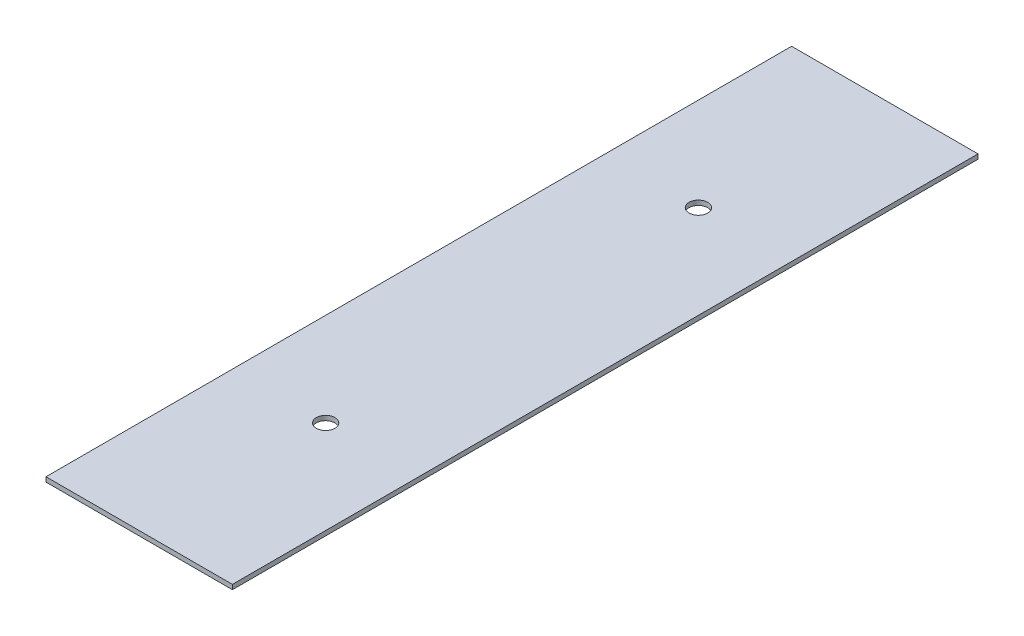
from build123d import *

# Parameters (mm, degrees)
EXTRUDE1_DEPTH      = 508
EXTRUDE1_DEPTH_BACK = 508
SKETCH3_W           = 254
SKETCH3_H           = 6.35
SKETCH5_R           = 12.7
CUT_EXTRUDE1_DEPTH  = 1368.8466005


with BuildPart() as part:
    # Sketch3 → Extrude1 (new, two sides: drawn at the far end of the back side and taken through both)
    with BuildSketch(Plane.XY.offset(-EXTRUDE1_DEPTH_BACK)):
        with Locations((-1143, -1139.825)):
            Rectangle(SKETCH3_W, SKETCH3_H)
    extrude(amount=EXTRUDE1_DEPTH + EXTRUDE1_DEPTH_BACK)

    # Sketch5 → Cut-Extrude1 (cut, through all)
    with BuildSketch(Plane(origin=(0, -1136.65, 0), x_dir=(1, 0, 0), z_dir=(0, 1, 0))):
        with Locations(Location((-1143, -254, 0), (0, 0, 270))):
            Circle(SKETCH5_R)
        with Locations(Location((-1143, 254, 0), (0, 0, 90))):
            Circle(SKETCH5_R)
    extrude(amount=-CUT_EXTRUDE1_DEPTH, mode=Mode.SUBTRACT)


solid = part.part
